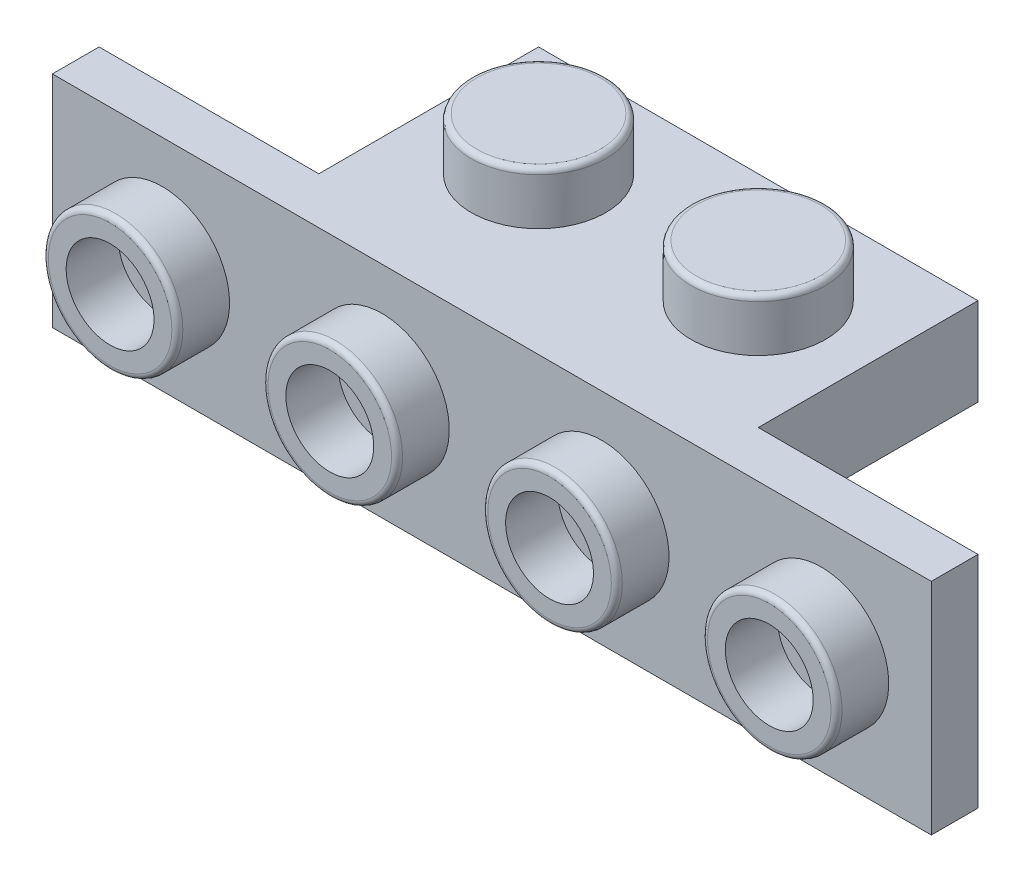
from build123d import *

# Parameters (mm, degrees)
SKIZZE1_W                       = 16
SKIZZE1_H                       = 8
LINEAR_AUSTRAGEN1_DEPTH         = 3.2
SKIZZE3_W                       = 32
SKIZZE3_H                       = 8
LINEAR_AUSTRAGEN2_DEPTH         = 1.7
SKIZZE4_R                       = 2.45
LINEAR_AUSTRAGEN3_DEPTH         = 1.9
VERRUNDUNG1_R                   = 0.2
SKIZZE5_R                       = 2.45
SKIZZE5_R_2                     = 1.6
LINEAR_AUSTRAGEN4_DEPTH         = 1.9
VERRUNDUNG2_R                   = 0.2
SKIZZE6_W                       = 12.8
SKIZZE6_H                       = 6.4
SCHNITT_LINEAR_AUSTRAGEN1_DEPTH = 2.1
SKIZZE7_R                       = 1.6
SCHNITT_LINEAR_AUSTRAGEN2_DEPTH = 1.8
SKIZZE8_R                       = 1.599999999
SKIZZE8_R_2                     = 0.799999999
LINEAR_AUSTRAGEN5_DEPTH         = 1.9
SKIZZE9_W                       = 1.3
SKIZZE9_H                       = 1.6
LINEAR_AUSTRAGEN6_DEPTH         = 1.9
FASE1_SIZE                      = 0.5


with BuildPart() as part:
    # Skizze1 → Linear austragen1 (new body)
    with BuildSketch(Plane(origin=(0, 0, 0), x_dir=(1, 0, 0), z_dir=(0, 1, 0))):
        with Locations((8, 4)):
            Rectangle(SKIZZE1_W, SKIZZE1_H)
    extrude(amount=LINEAR_AUSTRAGEN1_DEPTH)

    # Skizze3 → Linear austragen2 (add)
    with BuildSketch(Plane.XY):
        with Locations((8, -0.8)):
            Rectangle(SKIZZE3_W, SKIZZE3_H)
    extrude(amount=LINEAR_AUSTRAGEN2_DEPTH)

    # Skizze4 → Linear austragen3 (add)
    with BuildSketch(Plane(origin=(0, 3.2, 0), x_dir=(-1, 0, 0), z_dir=(0, 1, 0))):
        with Locations(Location((-12, -4, 0), (0, 0, 270))):
            Circle(SKIZZE4_R)
        with Locations(Location((-4, -4, 0), (0, 0, 270))):
            Circle(SKIZZE4_R)
    extrude(amount=LINEAR_AUSTRAGEN3_DEPTH)

    # Verrundung1
    verrundung1_edges = [part.edges().sort_by_distance(p)[0] for p in [
        (12, 5.1, -1.55),
        (4, 5.1, -1.55),
    ]]
    fillet(verrundung1_edges, radius=VERRUNDUNG1_R)

    # Skizze5 → Linear austragen4 (add)
    # profile 1 of 4: a face of its own
    with BuildSketch(Plane.XY.offset(1.7)):
        with Locations(Location((-4, -0.8, 0), (0, 0, 180))):
            Circle(SKIZZE5_R)
        with Locations(Location((-4, -0.8, 0), (0, 0, 180))):
            Circle(SKIZZE5_R_2, mode=Mode.SUBTRACT)
    # profile 2 of 4: a face of its own
    with BuildSketch(Plane.XY.offset(1.7)):
        with Locations(Location((4, -0.8, 0), (0, 0, 180))):
            Circle(SKIZZE5_R)
        with Locations(Location((4, -0.8, 0), (0, 0, 180))):
            Circle(SKIZZE5_R_2, mode=Mode.SUBTRACT)
    # profile 3 of 4: a face of its own
    with BuildSketch(Plane.XY.offset(1.7)):
        with Locations(Location((12, -0.8, 0), (0, 0, 180))):
            Circle(SKIZZE5_R)
        with Locations(Location((12, -0.8, 0), (0, 0, 180))):
            Circle(SKIZZE5_R_2, mode=Mode.SUBTRACT)
    # profile 4 of 4: a face of its own
    with BuildSketch(Plane.XY.offset(1.7)):
        with Locations(Location((20, -0.8, 0), (0, 0, 180))):
            Circle(SKIZZE5_R)
        with Locations(Location((20, -0.8, 0), (0, 0, 180))):
            Circle(SKIZZE5_R_2, mode=Mode.SUBTRACT)
    extrude(amount=LINEAR_AUSTRAGEN4_DEPTH)

    # Verrundung2
    verrundung2_edges = [part.edges().sort_by_distance(p)[0] for p in [
        (-1.55, -0.8, 3.6),
        (6.45, -0.8, 3.6),
        (14.45, -0.8, 3.6),
        (22.45, -0.8, 3.6),
    ]]
    fillet(verrundung2_edges, radius=VERRUNDUNG2_R)

    # Skizze6 → Schnitt-Linear austragen1 (cut)
    with BuildSketch(Plane.XZ):
        with Locations((8, -3.2)):
            Rectangle(SKIZZE6_W, SKIZZE6_H)
    extrude(amount=-SCHNITT_LINEAR_AUSTRAGEN1_DEPTH, mode=Mode.SUBTRACT)

    # Skizze7 → Schnitt-Linear austragen2 (cut)
    with BuildSketch(Plane.XZ.offset(-2.1)):
        with Locations(Location((4, -4, 0), (0, 0, 270))):
            Circle(SKIZZE7_R)
        with Locations(Location((12, -4, 0), (0, 0, 270))):
            Circle(SKIZZE7_R)
    extrude(amount=-SCHNITT_LINEAR_AUSTRAGEN2_DEPTH, mode=Mode.SUBTRACT)

    # Skizze8 → Linear austragen5 (add)
    with BuildSketch(Plane.XZ.offset(-2.1)):
        with Locations(Location((8, -4.00018362, 0), (0, 0, 90))):
            Circle(SKIZZE8_R)
        with Locations(Location((8, -4.00018362, 0), (0, 0, 90))):
            Circle(SKIZZE8_R_2, mode=Mode.SUBTRACT)
    extrude(amount=LINEAR_AUSTRAGEN5_DEPTH)

    # Skizze9 → Linear austragen6 (add)
    with BuildSketch(Plane.XZ.offset(-2.1)):
        with Locations((11.9, -0.8)):
            Rectangle(SKIZZE9_W, SKIZZE9_H)
        with Locations((3.9, -0.8)):
            Rectangle(SKIZZE9_W, SKIZZE9_H)
    extrude(amount=LINEAR_AUSTRAGEN6_DEPTH)

    # Fase1
    fase1_edges = [part.edges().sort_by_distance(p)[0] for p in [
        (7.9, 2.1, 0),
        (2.425, 2.1, 0),
        (13.475, 2.1, 0),
    ]]
    chamfer(fase1_edges, length=FASE1_SIZE)


solid = part.part
